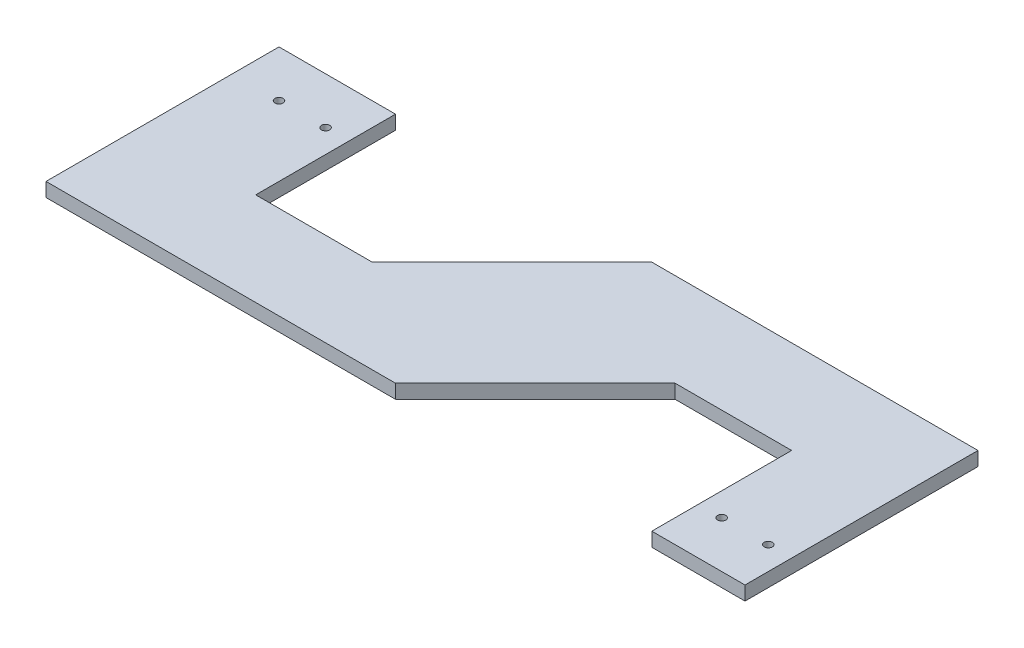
ISO-10303-21;
HEADER;
FILE_DESCRIPTION(('STEP AP214'),'2;1');
FILE_NAME('part.step','',(''),(''),'','','');
FILE_SCHEMA(('AUTOMOTIVE_DESIGN { 1 0 10303 214 1 1 1 1 }'));
ENDSEC;
DATA;
#1=APPLICATION_CONTEXT('core data for automotive mechanical design processes');
#2=APPLICATION_PROTOCOL_DEFINITION('international standard','automotive_design',2000,#1);
#3=PRODUCT_CONTEXT('',#1,'mechanical');
#4=PRODUCT('Part','Part','',(#3));
#5=PRODUCT_RELATED_PRODUCT_CATEGORY('part','',(#4));
#6=PRODUCT_DEFINITION_FORMATION('','',#4);
#7=PRODUCT_DEFINITION_CONTEXT('part definition',#1,'design');
#8=PRODUCT_DEFINITION('design','',#6,#7);
#9=PRODUCT_DEFINITION_SHAPE('','',#8);
#10=(LENGTH_UNIT() NAMED_UNIT(*) SI_UNIT(.MILLI.,.METRE.));
#11=(NAMED_UNIT(*) PLANE_ANGLE_UNIT() SI_UNIT($,.RADIAN.));
#12=(NAMED_UNIT(*) SI_UNIT($,.STERADIAN.) SOLID_ANGLE_UNIT());
#13=UNCERTAINTY_MEASURE_WITH_UNIT(LENGTH_MEASURE(1.E-05),#10,'distance_accuracy_value','');
#14=(GEOMETRIC_REPRESENTATION_CONTEXT(3) GLOBAL_UNCERTAINTY_ASSIGNED_CONTEXT((#13)) GLOBAL_UNIT_ASSIGNED_CONTEXT((#10,
#11,#12)) REPRESENTATION_CONTEXT('',''));
#15=CARTESIAN_POINT('',(0.,0.,0.));
#16=DIRECTION('',(0.,0.,1.));
#17=DIRECTION('',(1.,0.,0.));
#18=AXIS2_PLACEMENT_3D('',#15,#16,#17);
#19=CARTESIAN_POINT('',(20.,6.,-80.));
#20=DIRECTION('',(0.,-1.,0.));
#21=DIRECTION('',(0.,0.,-1.));
#22=AXIS2_PLACEMENT_3D('',#19,#20,#21);
#23=CYLINDRICAL_SURFACE('',#22,1.75);
#24=CARTESIAN_POINT('',(20.,6.,-80.));
#25=DIRECTION('',(0.,1.,0.));
#26=DIRECTION('',(0.,0.,1.));
#27=AXIS2_PLACEMENT_3D('',#24,#25,#26);
#28=CIRCLE('',#27,1.75);
#29=CARTESIAN_POINT('',(20.,6.,-78.25));
#30=VERTEX_POINT('',#29);
#31=EDGE_CURVE('E158',#30,#30,#28,.T.);
#32=ORIENTED_EDGE('',*,*,#31,.T.);
#33=EDGE_LOOP('',(#32));
#34=FACE_BOUND('',#33,.T.);
#35=CARTESIAN_POINT('',(20.,3.,-80.));
#36=DIRECTION('',(0.,-1.,0.));
#37=DIRECTION('',(0.,0.,-1.));
#38=AXIS2_PLACEMENT_3D('',#35,#36,#37);
#39=CIRCLE('',#38,1.75);
#40=CARTESIAN_POINT('',(20.,3.,-81.75));
#41=VERTEX_POINT('',#40);
#42=EDGE_CURVE('E34',#41,#41,#39,.T.);
#43=ORIENTED_EDGE('',*,*,#42,.T.);
#44=EDGE_LOOP('',(#43));
#45=FACE_BOUND('',#44,.T.);
#46=ADVANCED_FACE('F30',(#34,#45),#23,.F.);
#47=CARTESIAN_POINT('',(40.,6.,-80.));
#48=DIRECTION('',(0.,-1.,0.));
#49=DIRECTION('',(0.,0.,-1.));
#50=AXIS2_PLACEMENT_3D('',#47,#48,#49);
#51=CYLINDRICAL_SURFACE('',#50,1.75);
#52=CARTESIAN_POINT('',(40.,6.,-80.));
#53=DIRECTION('',(0.,1.,0.));
#54=DIRECTION('',(0.,0.,1.));
#55=AXIS2_PLACEMENT_3D('',#52,#53,#54);
#56=CIRCLE('',#55,1.75);
#57=CARTESIAN_POINT('',(40.,6.,-78.25));
#58=VERTEX_POINT('',#57);
#59=EDGE_CURVE('E237',#58,#58,#56,.T.);
#60=ORIENTED_EDGE('',*,*,#59,.T.);
#61=EDGE_LOOP('',(#60));
#62=FACE_BOUND('',#61,.T.);
#63=CARTESIAN_POINT('',(40.,3.,-80.));
#64=DIRECTION('',(0.,-1.,0.));
#65=DIRECTION('',(0.,0.,-1.));
#66=AXIS2_PLACEMENT_3D('',#63,#64,#65);
#67=CIRCLE('',#66,1.75);
#68=CARTESIAN_POINT('',(40.,3.,-81.75));
#69=VERTEX_POINT('',#68);
#70=EDGE_CURVE('E210',#69,#69,#67,.T.);
#71=ORIENTED_EDGE('',*,*,#70,.T.);
#72=EDGE_LOOP('',(#71));
#73=FACE_BOUND('',#72,.T.);
#74=ADVANCED_FACE('F289',(#62,#73),#51,.F.);
#75=CARTESIAN_POINT('',(270.,6.,-20.));
#76=DIRECTION('',(0.,-1.,0.));
#77=DIRECTION('',(0.,0.,-1.));
#78=AXIS2_PLACEMENT_3D('',#75,#76,#77);
#79=CYLINDRICAL_SURFACE('',#78,1.75000000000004);
#80=CARTESIAN_POINT('',(270.,6.,-20.));
#81=DIRECTION('',(0.,1.,0.));
#82=DIRECTION('',(0.,0.,1.));
#83=AXIS2_PLACEMENT_3D('',#80,#81,#82);
#84=CIRCLE('',#83,1.75000000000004);
#85=CARTESIAN_POINT('',(270.,6.,-18.25));
#86=VERTEX_POINT('',#85);
#87=EDGE_CURVE('E204',#86,#86,#84,.T.);
#88=ORIENTED_EDGE('',*,*,#87,.T.);
#89=EDGE_LOOP('',(#88));
#90=FACE_BOUND('',#89,.T.);
#91=CARTESIAN_POINT('',(270.,3.,-20.));
#92=DIRECTION('',(0.,-1.,0.));
#93=DIRECTION('',(0.,0.,-1.));
#94=AXIS2_PLACEMENT_3D('',#91,#92,#93);
#95=CIRCLE('',#94,1.75000000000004);
#96=CARTESIAN_POINT('',(270.,3.,-21.75));
#97=VERTEX_POINT('',#96);
#98=EDGE_CURVE('E206',#97,#97,#95,.T.);
#99=ORIENTED_EDGE('',*,*,#98,.T.);
#100=EDGE_LOOP('',(#99));
#101=FACE_BOUND('',#100,.T.);
#102=ADVANCED_FACE('F295',(#90,#101),#79,.F.);
#103=CARTESIAN_POINT('',(290.,6.,-20.));
#104=DIRECTION('',(0.,-1.,0.));
#105=DIRECTION('',(0.,0.,-1.));
#106=AXIS2_PLACEMENT_3D('',#103,#104,#105);
#107=CYLINDRICAL_SURFACE('',#106,1.75000000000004);
#108=CARTESIAN_POINT('',(290.,6.,-20.));
#109=DIRECTION('',(0.,1.,0.));
#110=DIRECTION('',(0.,0.,1.));
#111=AXIS2_PLACEMENT_3D('',#108,#109,#110);
#112=CIRCLE('',#111,1.75000000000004);
#113=CARTESIAN_POINT('',(290.,6.,-18.25));
#114=VERTEX_POINT('',#113);
#115=EDGE_CURVE('E240',#114,#114,#112,.T.);
#116=ORIENTED_EDGE('',*,*,#115,.T.);
#117=EDGE_LOOP('',(#116));
#118=FACE_BOUND('',#117,.T.);
#119=CARTESIAN_POINT('',(290.,3.,-20.));
#120=DIRECTION('',(0.,-1.,0.));
#121=DIRECTION('',(0.,0.,-1.));
#122=AXIS2_PLACEMENT_3D('',#119,#120,#121);
#123=CIRCLE('',#122,1.75000000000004);
#124=CARTESIAN_POINT('',(290.,3.,-21.75));
#125=VERTEX_POINT('',#124);
#126=EDGE_CURVE('E201',#125,#125,#123,.T.);
#127=ORIENTED_EDGE('',*,*,#126,.T.);
#128=EDGE_LOOP('',(#127));
#129=FACE_BOUND('',#128,.T.);
#130=ADVANCED_FACE('F301',(#118,#129),#107,.F.);
#131=CARTESIAN_POINT('',(0.,6.,-100.));
#132=DIRECTION('',(0.,-1.,0.));
#133=DIRECTION('',(0.,0.,-1.));
#134=AXIS2_PLACEMENT_3D('',#131,#132,#133);
#135=PLANE('',#134);
#136=ORIENTED_EDGE('',*,*,#59,.F.);
#137=EDGE_LOOP('',(#136));
#138=FACE_BOUND('',#137,.T.);
#139=ORIENTED_EDGE('',*,*,#31,.F.);
#140=EDGE_LOOP('',(#139));
#141=FACE_BOUND('',#140,.T.);
#142=DIRECTION('',(0.,0.,1.));
#143=VECTOR('',#142,1.);
#144=CARTESIAN_POINT('',(0.,6.,0.));
#145=LINE('',#144,#143);
#146=CARTESIAN_POINT('',(0.,6.,-100.));
#147=VERTEX_POINT('',#146);
#148=CARTESIAN_POINT('',(0.,6.,0.));
#149=VERTEX_POINT('',#148);
#150=EDGE_CURVE('E177',#147,#149,#145,.T.);
#151=ORIENTED_EDGE('',*,*,#150,.T.);
#152=DIRECTION('',(1.,0.,0.));
#153=VECTOR('',#152,1.);
#154=CARTESIAN_POINT('',(0.,6.,0.));
#155=LINE('',#154,#153);
#156=CARTESIAN_POINT('',(150.,6.,0.));
#157=VERTEX_POINT('',#156);
#158=EDGE_CURVE('E104',#149,#157,#155,.T.);
#159=ORIENTED_EDGE('',*,*,#158,.T.);
#160=DIRECTION('',(0.707106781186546,0.,-0.707106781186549));
#161=VECTOR('',#160,1.);
#162=CARTESIAN_POINT('',(210.,6.,-60.));
#163=LINE('',#162,#161);
#164=CARTESIAN_POINT('',(210.,6.,-60.));
#165=VERTEX_POINT('',#164);
#166=EDGE_CURVE('E247',#157,#165,#163,.T.);
#167=ORIENTED_EDGE('',*,*,#166,.T.);
#168=DIRECTION('',(1.,0.,0.));
#169=VECTOR('',#168,1.);
#170=CARTESIAN_POINT('',(260.,6.,-60.));
#171=LINE('',#170,#169);
#172=CARTESIAN_POINT('',(260.,6.,-60.));
#173=VERTEX_POINT('',#172);
#174=EDGE_CURVE('E249',#165,#173,#171,.T.);
#175=ORIENTED_EDGE('',*,*,#174,.T.);
#176=DIRECTION('',(0.,0.,1.));
#177=VECTOR('',#176,1.);
#178=CARTESIAN_POINT('',(260.,6.,0.));
#179=LINE('',#178,#177);
#180=CARTESIAN_POINT('',(260.,6.,0.));
#181=VERTEX_POINT('',#180);
#182=EDGE_CURVE('E251',#173,#181,#179,.T.);
#183=ORIENTED_EDGE('',*,*,#182,.T.);
#184=DIRECTION('',(1.,0.,0.));
#185=VECTOR('',#184,1.);
#186=CARTESIAN_POINT('',(260.,6.,0.));
#187=LINE('',#186,#185);
#188=CARTESIAN_POINT('',(300.,6.,0.));
#189=VERTEX_POINT('',#188);
#190=EDGE_CURVE('E253',#181,#189,#187,.T.);
#191=ORIENTED_EDGE('',*,*,#190,.T.);
#192=DIRECTION('',(0.,0.,-1.));
#193=VECTOR('',#192,1.);
#194=CARTESIAN_POINT('',(300.,6.,0.));
#195=LINE('',#194,#193);
#196=CARTESIAN_POINT('',(300.,6.,-100.));
#197=VERTEX_POINT('',#196);
#198=EDGE_CURVE('E255',#189,#197,#195,.T.);
#199=ORIENTED_EDGE('',*,*,#198,.T.);
#200=DIRECTION('',(-1.,0.,0.));
#201=VECTOR('',#200,1.);
#202=CARTESIAN_POINT('',(160.,6.,-100.));
#203=LINE('',#202,#201);
#204=CARTESIAN_POINT('',(160.,6.,-100.));
#205=VERTEX_POINT('',#204);
#206=EDGE_CURVE('E257',#197,#205,#203,.T.);
#207=ORIENTED_EDGE('',*,*,#206,.T.);
#208=DIRECTION('',(-0.707106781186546,0.,0.707106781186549));
#209=VECTOR('',#208,1.);
#210=CARTESIAN_POINT('',(100.,6.,-40.));
#211=LINE('',#210,#209);
#212=CARTESIAN_POINT('',(100.,6.,-40.));
#213=VERTEX_POINT('',#212);
#214=EDGE_CURVE('E136',#205,#213,#211,.T.);
#215=ORIENTED_EDGE('',*,*,#214,.T.);
#216=DIRECTION('',(-1.,0.,0.));
#217=VECTOR('',#216,1.);
#218=CARTESIAN_POINT('',(50.,6.,-40.));
#219=LINE('',#218,#217);
#220=CARTESIAN_POINT('',(50.,6.,-40.));
#221=VERTEX_POINT('',#220);
#222=EDGE_CURVE('E129',#213,#221,#219,.T.);
#223=ORIENTED_EDGE('',*,*,#222,.T.);
#224=DIRECTION('',(0.,0.,-1.));
#225=VECTOR('',#224,1.);
#226=CARTESIAN_POINT('',(50.,6.,-100.));
#227=LINE('',#226,#225);
#228=CARTESIAN_POINT('',(50.,6.,-100.));
#229=VERTEX_POINT('',#228);
#230=EDGE_CURVE('E134',#221,#229,#227,.T.);
#231=ORIENTED_EDGE('',*,*,#230,.T.);
#232=DIRECTION('',(-1.,0.,0.));
#233=VECTOR('',#232,1.);
#234=CARTESIAN_POINT('',(0.,6.,-100.));
#235=LINE('',#234,#233);
#236=EDGE_CURVE('E49',#229,#147,#235,.T.);
#237=ORIENTED_EDGE('',*,*,#236,.T.);
#238=EDGE_LOOP('',(#151,#159,#167,#175,#183,#191,#199,#207,#215,#223,#231,#237));
#239=FACE_BOUND('',#238,.T.);
#240=ORIENTED_EDGE('',*,*,#115,.F.);
#241=EDGE_LOOP('',(#240));
#242=FACE_BOUND('',#241,.T.);
#243=ORIENTED_EDGE('',*,*,#87,.F.);
#244=EDGE_LOOP('',(#243));
#245=FACE_BOUND('',#244,.T.);
#246=ADVANCED_FACE('F131',(#138,#141,#239,#242,#245),#135,.F.);
#247=CARTESIAN_POINT('',(0.,0.,-100.));
#248=DIRECTION('',(0.,-1.,0.));
#249=DIRECTION('',(0.,0.,-1.));
#250=AXIS2_PLACEMENT_3D('',#247,#248,#249);
#251=PLANE('',#250);
#252=CARTESIAN_POINT('',(20.,0.,-80.));
#253=DIRECTION('',(0.,-1.,0.));
#254=DIRECTION('',(0.,0.,-1.));
#255=AXIS2_PLACEMENT_3D('',#252,#253,#254);
#256=CIRCLE('',#255,3.25);
#257=CARTESIAN_POINT('',(20.,0.,-83.25));
#258=VERTEX_POINT('',#257);
#259=EDGE_CURVE('E226',#258,#258,#256,.T.);
#260=ORIENTED_EDGE('',*,*,#259,.F.);
#261=EDGE_LOOP('',(#260));
#262=FACE_BOUND('',#261,.T.);
#263=CARTESIAN_POINT('',(40.,0.,-80.));
#264=DIRECTION('',(0.,-1.,0.));
#265=DIRECTION('',(0.,0.,-1.));
#266=AXIS2_PLACEMENT_3D('',#263,#264,#265);
#267=CIRCLE('',#266,3.25);
#268=CARTESIAN_POINT('',(40.,0.,-83.25));
#269=VERTEX_POINT('',#268);
#270=EDGE_CURVE('E219',#269,#269,#267,.T.);
#271=ORIENTED_EDGE('',*,*,#270,.F.);
#272=EDGE_LOOP('',(#271));
#273=FACE_BOUND('',#272,.T.);
#274=CARTESIAN_POINT('',(270.,0.,-20.));
#275=DIRECTION('',(0.,-1.,0.));
#276=DIRECTION('',(0.,0.,-1.));
#277=AXIS2_PLACEMENT_3D('',#274,#275,#276);
#278=CIRCLE('',#277,3.25000000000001);
#279=CARTESIAN_POINT('',(270.,0.,-23.25));
#280=VERTEX_POINT('',#279);
#281=EDGE_CURVE('E212',#280,#280,#278,.T.);
#282=ORIENTED_EDGE('',*,*,#281,.F.);
#283=EDGE_LOOP('',(#282));
#284=FACE_BOUND('',#283,.T.);
#285=CARTESIAN_POINT('',(290.,0.,-20.));
#286=DIRECTION('',(0.,-1.,0.));
#287=DIRECTION('',(0.,0.,-1.));
#288=AXIS2_PLACEMENT_3D('',#285,#286,#287);
#289=CIRCLE('',#288,3.25000000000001);
#290=CARTESIAN_POINT('',(290.,0.,-23.25));
#291=VERTEX_POINT('',#290);
#292=EDGE_CURVE('E208',#291,#291,#289,.T.);
#293=ORIENTED_EDGE('',*,*,#292,.F.);
#294=EDGE_LOOP('',(#293));
#295=FACE_BOUND('',#294,.T.);
#296=DIRECTION('',(0.,0.,1.));
#297=VECTOR('',#296,1.);
#298=CARTESIAN_POINT('',(0.,0.,0.));
#299=LINE('',#298,#297);
#300=CARTESIAN_POINT('',(0.,0.,-100.));
#301=VERTEX_POINT('',#300);
#302=CARTESIAN_POINT('',(0.,0.,0.));
#303=VERTEX_POINT('',#302);
#304=EDGE_CURVE('E154',#301,#303,#299,.T.);
#305=ORIENTED_EDGE('',*,*,#304,.F.);
#306=DIRECTION('',(-1.,0.,0.));
#307=VECTOR('',#306,1.);
#308=CARTESIAN_POINT('',(0.,0.,-100.));
#309=LINE('',#308,#307);
#310=CARTESIAN_POINT('',(50.,0.,-100.));
#311=VERTEX_POINT('',#310);
#312=EDGE_CURVE('E96',#311,#301,#309,.T.);
#313=ORIENTED_EDGE('',*,*,#312,.F.);
#314=DIRECTION('',(0.,0.,-1.));
#315=VECTOR('',#314,1.);
#316=CARTESIAN_POINT('',(50.,0.,-100.));
#317=LINE('',#316,#315);
#318=CARTESIAN_POINT('',(50.,0.,-40.));
#319=VERTEX_POINT('',#318);
#320=EDGE_CURVE('E90',#319,#311,#317,.T.);
#321=ORIENTED_EDGE('',*,*,#320,.F.);
#322=DIRECTION('',(-1.,0.,0.));
#323=VECTOR('',#322,1.);
#324=CARTESIAN_POINT('',(50.,0.,-40.));
#325=LINE('',#324,#323);
#326=CARTESIAN_POINT('',(100.,0.,-40.));
#327=VERTEX_POINT('',#326);
#328=EDGE_CURVE('E144',#327,#319,#325,.T.);
#329=ORIENTED_EDGE('',*,*,#328,.F.);
#330=DIRECTION('',(-0.707106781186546,0.,0.707106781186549));
#331=VECTOR('',#330,1.);
#332=CARTESIAN_POINT('',(100.,0.,-40.));
#333=LINE('',#332,#331);
#334=CARTESIAN_POINT('',(160.,0.,-100.));
#335=VERTEX_POINT('',#334);
#336=EDGE_CURVE('E172',#335,#327,#333,.T.);
#337=ORIENTED_EDGE('',*,*,#336,.F.);
#338=DIRECTION('',(-1.,0.,0.));
#339=VECTOR('',#338,1.);
#340=CARTESIAN_POINT('',(160.,0.,-100.));
#341=LINE('',#340,#339);
#342=CARTESIAN_POINT('',(300.,0.,-100.));
#343=VERTEX_POINT('',#342);
#344=EDGE_CURVE('E170',#343,#335,#341,.T.);
#345=ORIENTED_EDGE('',*,*,#344,.F.);
#346=DIRECTION('',(0.,0.,-1.));
#347=VECTOR('',#346,1.);
#348=CARTESIAN_POINT('',(300.,0.,0.));
#349=LINE('',#348,#347);
#350=CARTESIAN_POINT('',(300.,0.,0.));
#351=VERTEX_POINT('',#350);
#352=EDGE_CURVE('E168',#351,#343,#349,.T.);
#353=ORIENTED_EDGE('',*,*,#352,.F.);
#354=DIRECTION('',(1.,0.,0.));
#355=VECTOR('',#354,1.);
#356=CARTESIAN_POINT('',(260.,0.,0.));
#357=LINE('',#356,#355);
#358=CARTESIAN_POINT('',(260.,0.,0.));
#359=VERTEX_POINT('',#358);
#360=EDGE_CURVE('E166',#359,#351,#357,.T.);
#361=ORIENTED_EDGE('',*,*,#360,.F.);
#362=DIRECTION('',(0.,0.,1.));
#363=VECTOR('',#362,1.);
#364=CARTESIAN_POINT('',(260.,0.,0.));
#365=LINE('',#364,#363);
#366=CARTESIAN_POINT('',(260.,0.,-60.));
#367=VERTEX_POINT('',#366);
#368=EDGE_CURVE('E164',#367,#359,#365,.T.);
#369=ORIENTED_EDGE('',*,*,#368,.F.);
#370=DIRECTION('',(1.,0.,0.));
#371=VECTOR('',#370,1.);
#372=CARTESIAN_POINT('',(260.,0.,-60.));
#373=LINE('',#372,#371);
#374=CARTESIAN_POINT('',(210.,0.,-60.));
#375=VERTEX_POINT('',#374);
#376=EDGE_CURVE('E162',#375,#367,#373,.T.);
#377=ORIENTED_EDGE('',*,*,#376,.F.);
#378=DIRECTION('',(0.707106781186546,0.,-0.707106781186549));
#379=VECTOR('',#378,1.);
#380=CARTESIAN_POINT('',(210.,0.,-60.));
#381=LINE('',#380,#379);
#382=CARTESIAN_POINT('',(150.,0.,0.));
#383=VERTEX_POINT('',#382);
#384=EDGE_CURVE('E160',#383,#375,#381,.T.);
#385=ORIENTED_EDGE('',*,*,#384,.F.);
#386=DIRECTION('',(1.,0.,0.));
#387=VECTOR('',#386,1.);
#388=CARTESIAN_POINT('',(0.,0.,0.));
#389=LINE('',#388,#387);
#390=EDGE_CURVE('E157',#303,#383,#389,.T.);
#391=ORIENTED_EDGE('',*,*,#390,.F.);
#392=EDGE_LOOP('',(#305,#313,#321,#329,#337,#345,#353,#361,#369,#377,#385,#391));
#393=FACE_BOUND('',#392,.T.);
#394=ADVANCED_FACE('F270',(#262,#273,#284,#295,#393),#251,.T.);
#395=CARTESIAN_POINT('',(0.,6.,0.));
#396=DIRECTION('',(1.,0.,0.));
#397=DIRECTION('',(0.,0.,-1.));
#398=AXIS2_PLACEMENT_3D('',#395,#396,#397);
#399=PLANE('',#398);
#400=ORIENTED_EDGE('',*,*,#304,.T.);
#401=DIRECTION('',(0.,-1.,0.));
#402=VECTOR('',#401,1.);
#403=CARTESIAN_POINT('',(0.,6.,0.));
#404=LINE('',#403,#402);
#405=EDGE_CURVE('E11',#149,#303,#404,.T.);
#406=ORIENTED_EDGE('',*,*,#405,.F.);
#407=ORIENTED_EDGE('',*,*,#150,.F.);
#408=DIRECTION('',(0.,-1.,0.));
#409=VECTOR('',#408,1.);
#410=CARTESIAN_POINT('',(0.,6.,-100.));
#411=LINE('',#410,#409);
#412=EDGE_CURVE('E150',#147,#301,#411,.T.);
#413=ORIENTED_EDGE('',*,*,#412,.T.);
#414=EDGE_LOOP('',(#400,#406,#407,#413));
#415=FACE_BOUND('',#414,.T.);
#416=ADVANCED_FACE('F32',(#415),#399,.F.);
#417=CARTESIAN_POINT('',(0.,6.,0.));
#418=DIRECTION('',(0.,0.,-1.));
#419=DIRECTION('',(-1.,0.,0.));
#420=AXIS2_PLACEMENT_3D('',#417,#418,#419);
#421=PLANE('',#420);
#422=ORIENTED_EDGE('',*,*,#390,.T.);
#423=DIRECTION('',(0.,-1.,0.));
#424=VECTOR('',#423,1.);
#425=CARTESIAN_POINT('',(150.,6.,0.));
#426=LINE('',#425,#424);
#427=EDGE_CURVE('E40',#157,#383,#426,.T.);
#428=ORIENTED_EDGE('',*,*,#427,.F.);
#429=ORIENTED_EDGE('',*,*,#158,.F.);
#430=ORIENTED_EDGE('',*,*,#405,.T.);
#431=EDGE_LOOP('',(#422,#428,#429,#430));
#432=FACE_BOUND('',#431,.T.);
#433=ADVANCED_FACE('F309',(#432),#421,.F.);
#434=CARTESIAN_POINT('',(210.,6.,-60.));
#435=DIRECTION('',(-0.707106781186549,0.,-0.707106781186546));
#436=DIRECTION('',(-0.707106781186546,0.,0.707106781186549));
#437=AXIS2_PLACEMENT_3D('',#434,#435,#436);
#438=PLANE('',#437);
#439=ORIENTED_EDGE('',*,*,#384,.T.);
#440=DIRECTION('',(0.,-1.,0.));
#441=VECTOR('',#440,1.);
#442=CARTESIAN_POINT('',(210.,6.,-60.));
#443=LINE('',#442,#441);
#444=EDGE_CURVE('E196',#165,#375,#443,.T.);
#445=ORIENTED_EDGE('',*,*,#444,.F.);
#446=ORIENTED_EDGE('',*,*,#166,.F.);
#447=ORIENTED_EDGE('',*,*,#427,.T.);
#448=EDGE_LOOP('',(#439,#445,#446,#447));
#449=FACE_BOUND('',#448,.T.);
#450=ADVANCED_FACE('F375',(#449),#438,.F.);
#451=CARTESIAN_POINT('',(260.,6.,-60.));
#452=DIRECTION('',(0.,0.,-1.));
#453=DIRECTION('',(-1.,0.,0.));
#454=AXIS2_PLACEMENT_3D('',#451,#452,#453);
#455=PLANE('',#454);
#456=ORIENTED_EDGE('',*,*,#376,.T.);
#457=DIRECTION('',(0.,-1.,0.));
#458=VECTOR('',#457,1.);
#459=CARTESIAN_POINT('',(260.,6.,-60.));
#460=LINE('',#459,#458);
#461=EDGE_CURVE('E193',#173,#367,#460,.T.);
#462=ORIENTED_EDGE('',*,*,#461,.F.);
#463=ORIENTED_EDGE('',*,*,#174,.F.);
#464=ORIENTED_EDGE('',*,*,#444,.T.);
#465=EDGE_LOOP('',(#456,#462,#463,#464));
#466=FACE_BOUND('',#465,.T.);
#467=ADVANCED_FACE('F383',(#466),#455,.F.);
#468=CARTESIAN_POINT('',(260.,6.,0.));
#469=DIRECTION('',(1.,0.,0.));
#470=DIRECTION('',(0.,0.,-1.));
#471=AXIS2_PLACEMENT_3D('',#468,#469,#470);
#472=PLANE('',#471);
#473=ORIENTED_EDGE('',*,*,#368,.T.);
#474=DIRECTION('',(0.,-1.,0.));
#475=VECTOR('',#474,1.);
#476=CARTESIAN_POINT('',(260.,6.,0.));
#477=LINE('',#476,#475);
#478=EDGE_CURVE('E190',#181,#359,#477,.T.);
#479=ORIENTED_EDGE('',*,*,#478,.F.);
#480=ORIENTED_EDGE('',*,*,#182,.F.);
#481=ORIENTED_EDGE('',*,*,#461,.T.);
#482=EDGE_LOOP('',(#473,#479,#480,#481));
#483=FACE_BOUND('',#482,.T.);
#484=ADVANCED_FACE('F393',(#483),#472,.F.);
#485=CARTESIAN_POINT('',(260.,6.,0.));
#486=DIRECTION('',(0.,0.,-1.));
#487=DIRECTION('',(-1.,0.,0.));
#488=AXIS2_PLACEMENT_3D('',#485,#486,#487);
#489=PLANE('',#488);
#490=ORIENTED_EDGE('',*,*,#360,.T.);
#491=DIRECTION('',(0.,-1.,0.));
#492=VECTOR('',#491,1.);
#493=CARTESIAN_POINT('',(300.,6.,0.));
#494=LINE('',#493,#492);
#495=EDGE_CURVE('E187',#189,#351,#494,.T.);
#496=ORIENTED_EDGE('',*,*,#495,.F.);
#497=ORIENTED_EDGE('',*,*,#190,.F.);
#498=ORIENTED_EDGE('',*,*,#478,.T.);
#499=EDGE_LOOP('',(#490,#496,#497,#498));
#500=FACE_BOUND('',#499,.T.);
#501=ADVANCED_FACE('F403',(#500),#489,.F.);
#502=CARTESIAN_POINT('',(300.,6.,0.));
#503=DIRECTION('',(-1.,0.,0.));
#504=DIRECTION('',(0.,0.,1.));
#505=AXIS2_PLACEMENT_3D('',#502,#503,#504);
#506=PLANE('',#505);
#507=ORIENTED_EDGE('',*,*,#352,.T.);
#508=DIRECTION('',(0.,-1.,0.));
#509=VECTOR('',#508,1.);
#510=CARTESIAN_POINT('',(300.,6.,-100.));
#511=LINE('',#510,#509);
#512=EDGE_CURVE('E184',#197,#343,#511,.T.);
#513=ORIENTED_EDGE('',*,*,#512,.F.);
#514=ORIENTED_EDGE('',*,*,#198,.F.);
#515=ORIENTED_EDGE('',*,*,#495,.T.);
#516=EDGE_LOOP('',(#507,#513,#514,#515));
#517=FACE_BOUND('',#516,.T.);
#518=ADVANCED_FACE('F413',(#517),#506,.F.);
#519=CARTESIAN_POINT('',(160.,6.,-100.));
#520=DIRECTION('',(0.,0.,1.));
#521=DIRECTION('',(1.,0.,0.));
#522=AXIS2_PLACEMENT_3D('',#519,#520,#521);
#523=PLANE('',#522);
#524=ORIENTED_EDGE('',*,*,#344,.T.);
#525=DIRECTION('',(0.,-1.,0.));
#526=VECTOR('',#525,1.);
#527=CARTESIAN_POINT('',(160.,6.,-100.));
#528=LINE('',#527,#526);
#529=EDGE_CURVE('E181',#205,#335,#528,.T.);
#530=ORIENTED_EDGE('',*,*,#529,.F.);
#531=ORIENTED_EDGE('',*,*,#206,.F.);
#532=ORIENTED_EDGE('',*,*,#512,.T.);
#533=EDGE_LOOP('',(#524,#530,#531,#532));
#534=FACE_BOUND('',#533,.T.);
#535=ADVANCED_FACE('F263',(#534),#523,.F.);
#536=CARTESIAN_POINT('',(100.,6.,-40.));
#537=DIRECTION('',(0.707106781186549,0.,0.707106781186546));
#538=DIRECTION('',(0.707106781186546,0.,-0.707106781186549));
#539=AXIS2_PLACEMENT_3D('',#536,#537,#538);
#540=PLANE('',#539);
#541=ORIENTED_EDGE('',*,*,#336,.T.);
#542=DIRECTION('',(0.,-1.,0.));
#543=VECTOR('',#542,1.);
#544=CARTESIAN_POINT('',(100.,6.,-40.));
#545=LINE('',#544,#543);
#546=EDGE_CURVE('E145',#213,#327,#545,.T.);
#547=ORIENTED_EDGE('',*,*,#546,.F.);
#548=ORIENTED_EDGE('',*,*,#214,.F.);
#549=ORIENTED_EDGE('',*,*,#529,.T.);
#550=EDGE_LOOP('',(#541,#547,#548,#549));
#551=FACE_BOUND('',#550,.T.);
#552=ADVANCED_FACE('F267',(#551),#540,.F.);
#553=CARTESIAN_POINT('',(50.,6.,-40.));
#554=DIRECTION('',(0.,0.,1.));
#555=DIRECTION('',(1.,0.,0.));
#556=AXIS2_PLACEMENT_3D('',#553,#554,#555);
#557=PLANE('',#556);
#558=ORIENTED_EDGE('',*,*,#328,.T.);
#559=DIRECTION('',(0.,-1.,0.));
#560=VECTOR('',#559,1.);
#561=CARTESIAN_POINT('',(50.,6.,-40.));
#562=LINE('',#561,#560);
#563=EDGE_CURVE('E141',#221,#319,#562,.T.);
#564=ORIENTED_EDGE('',*,*,#563,.F.);
#565=ORIENTED_EDGE('',*,*,#222,.F.);
#566=ORIENTED_EDGE('',*,*,#546,.T.);
#567=EDGE_LOOP('',(#558,#564,#565,#566));
#568=FACE_BOUND('',#567,.T.);
#569=ADVANCED_FACE('F142',(#568),#557,.F.);
#570=CARTESIAN_POINT('',(50.,6.,-100.));
#571=DIRECTION('',(-1.,0.,0.));
#572=DIRECTION('',(0.,0.,1.));
#573=AXIS2_PLACEMENT_3D('',#570,#571,#572);
#574=PLANE('',#573);
#575=ORIENTED_EDGE('',*,*,#320,.T.);
#576=DIRECTION('',(0.,-1.,0.));
#577=VECTOR('',#576,1.);
#578=CARTESIAN_POINT('',(50.,6.,-100.));
#579=LINE('',#578,#577);
#580=EDGE_CURVE('E146',#229,#311,#579,.T.);
#581=ORIENTED_EDGE('',*,*,#580,.F.);
#582=ORIENTED_EDGE('',*,*,#230,.F.);
#583=ORIENTED_EDGE('',*,*,#563,.T.);
#584=EDGE_LOOP('',(#575,#581,#582,#583));
#585=FACE_BOUND('',#584,.T.);
#586=ADVANCED_FACE('F148',(#585),#574,.F.);
#587=CARTESIAN_POINT('',(0.,6.,-100.));
#588=DIRECTION('',(0.,0.,1.));
#589=DIRECTION('',(1.,0.,0.));
#590=AXIS2_PLACEMENT_3D('',#587,#588,#589);
#591=PLANE('',#590);
#592=ORIENTED_EDGE('',*,*,#312,.T.);
#593=ORIENTED_EDGE('',*,*,#412,.F.);
#594=ORIENTED_EDGE('',*,*,#236,.F.);
#595=ORIENTED_EDGE('',*,*,#580,.T.);
#596=EDGE_LOOP('',(#592,#593,#594,#595));
#597=FACE_BOUND('',#596,.T.);
#598=ADVANCED_FACE('F275',(#597),#591,.F.);
#599=CARTESIAN_POINT('',(290.,3.,-20.));
#600=DIRECTION('',(0.,-1.,0.));
#601=DIRECTION('',(0.,0.,-1.));
#602=AXIS2_PLACEMENT_3D('',#599,#600,#601);
#603=CYLINDRICAL_SURFACE('',#602,3.25000000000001);
#604=CARTESIAN_POINT('',(290.,3.,-20.));
#605=DIRECTION('',(0.,-1.,0.));
#606=DIRECTION('',(0.,0.,-1.));
#607=AXIS2_PLACEMENT_3D('',#604,#605,#606);
#608=CIRCLE('',#607,3.25000000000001);
#609=CARTESIAN_POINT('',(290.,3.,-23.25));
#610=VERTEX_POINT('',#609);
#611=EDGE_CURVE('E205',#610,#610,#608,.T.);
#612=ORIENTED_EDGE('',*,*,#611,.F.);
#613=EDGE_LOOP('',(#612));
#614=FACE_BOUND('',#613,.T.);
#615=ORIENTED_EDGE('',*,*,#292,.T.);
#616=EDGE_LOOP('',(#615));
#617=FACE_BOUND('',#616,.T.);
#618=ADVANCED_FACE('F277',(#614,#617),#603,.F.);
#619=CARTESIAN_POINT('',(290.,3.,-20.));
#620=DIRECTION('',(0.,-1.,0.));
#621=DIRECTION('',(0.,0.,-1.));
#622=AXIS2_PLACEMENT_3D('',#619,#620,#621);
#623=PLANE('',#622);
#624=ORIENTED_EDGE('',*,*,#126,.F.);
#625=EDGE_LOOP('',(#624));
#626=FACE_BOUND('',#625,.T.);
#627=ORIENTED_EDGE('',*,*,#611,.T.);
#628=EDGE_LOOP('',(#627));
#629=FACE_BOUND('',#628,.T.);
#630=ADVANCED_FACE('F283',(#626,#629),#623,.T.);
#631=CARTESIAN_POINT('',(270.,3.,-20.));
#632=DIRECTION('',(0.,-1.,0.));
#633=DIRECTION('',(0.,0.,-1.));
#634=AXIS2_PLACEMENT_3D('',#631,#632,#633);
#635=CYLINDRICAL_SURFACE('',#634,3.25000000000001);
#636=CARTESIAN_POINT('',(270.,3.,-20.));
#637=DIRECTION('',(0.,-1.,0.));
#638=DIRECTION('',(0.,0.,-1.));
#639=AXIS2_PLACEMENT_3D('',#636,#637,#638);
#640=CIRCLE('',#639,3.25000000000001);
#641=CARTESIAN_POINT('',(270.,3.,-23.25));
#642=VERTEX_POINT('',#641);
#643=EDGE_CURVE('E209',#642,#642,#640,.T.);
#644=ORIENTED_EDGE('',*,*,#643,.F.);
#645=EDGE_LOOP('',(#644));
#646=FACE_BOUND('',#645,.T.);
#647=ORIENTED_EDGE('',*,*,#281,.T.);
#648=EDGE_LOOP('',(#647));
#649=FACE_BOUND('',#648,.T.);
#650=ADVANCED_FACE('F320',(#646,#649),#635,.F.);
#651=CARTESIAN_POINT('',(270.,3.,-20.));
#652=DIRECTION('',(0.,-1.,0.));
#653=DIRECTION('',(0.,0.,-1.));
#654=AXIS2_PLACEMENT_3D('',#651,#652,#653);
#655=PLANE('',#654);
#656=ORIENTED_EDGE('',*,*,#98,.F.);
#657=EDGE_LOOP('',(#656));
#658=FACE_BOUND('',#657,.T.);
#659=ORIENTED_EDGE('',*,*,#643,.T.);
#660=EDGE_LOOP('',(#659));
#661=FACE_BOUND('',#660,.T.);
#662=ADVANCED_FACE('F322',(#658,#661),#655,.T.);
#663=CARTESIAN_POINT('',(40.,3.,-80.));
#664=DIRECTION('',(0.,-1.,0.));
#665=DIRECTION('',(0.,0.,-1.));
#666=AXIS2_PLACEMENT_3D('',#663,#664,#665);
#667=CYLINDRICAL_SURFACE('',#666,3.25);
#668=CARTESIAN_POINT('',(40.,3.,-80.));
#669=DIRECTION('',(0.,-1.,0.));
#670=DIRECTION('',(0.,0.,-1.));
#671=AXIS2_PLACEMENT_3D('',#668,#669,#670);
#672=CIRCLE('',#671,3.25);
#673=CARTESIAN_POINT('',(40.,3.,-83.25));
#674=VERTEX_POINT('',#673);
#675=EDGE_CURVE('E213',#674,#674,#672,.T.);
#676=ORIENTED_EDGE('',*,*,#675,.F.);
#677=EDGE_LOOP('',(#676));
#678=FACE_BOUND('',#677,.T.);
#679=ORIENTED_EDGE('',*,*,#270,.T.);
#680=EDGE_LOOP('',(#679));
#681=FACE_BOUND('',#680,.T.);
#682=ADVANCED_FACE('F329',(#678,#681),#667,.F.);
#683=CARTESIAN_POINT('',(40.,3.,-80.));
#684=DIRECTION('',(0.,-1.,0.));
#685=DIRECTION('',(0.,0.,-1.));
#686=AXIS2_PLACEMENT_3D('',#683,#684,#685);
#687=PLANE('',#686);
#688=ORIENTED_EDGE('',*,*,#70,.F.);
#689=EDGE_LOOP('',(#688));
#690=FACE_BOUND('',#689,.T.);
#691=ORIENTED_EDGE('',*,*,#675,.T.);
#692=EDGE_LOOP('',(#691));
#693=FACE_BOUND('',#692,.T.);
#694=ADVANCED_FACE('F502',(#690,#693),#687,.T.);
#695=CARTESIAN_POINT('',(20.,3.,-80.));
#696=DIRECTION('',(0.,-1.,0.));
#697=DIRECTION('',(0.,0.,-1.));
#698=AXIS2_PLACEMENT_3D('',#695,#696,#697);
#699=CYLINDRICAL_SURFACE('',#698,3.25);
#700=CARTESIAN_POINT('',(20.,3.,-80.));
#701=DIRECTION('',(0.,-1.,0.));
#702=DIRECTION('',(0.,0.,-1.));
#703=AXIS2_PLACEMENT_3D('',#700,#701,#702);
#704=CIRCLE('',#703,3.25);
#705=CARTESIAN_POINT('',(20.,3.,-83.25));
#706=VERTEX_POINT('',#705);
#707=EDGE_CURVE('E540',#706,#706,#704,.T.);
#708=ORIENTED_EDGE('',*,*,#707,.F.);
#709=EDGE_LOOP('',(#708));
#710=FACE_BOUND('',#709,.T.);
#711=ORIENTED_EDGE('',*,*,#259,.T.);
#712=EDGE_LOOP('',(#711));
#713=FACE_BOUND('',#712,.T.);
#714=ADVANCED_FACE('F510',(#710,#713),#699,.F.);
#715=CARTESIAN_POINT('',(20.,3.,-80.));
#716=DIRECTION('',(0.,-1.,0.));
#717=DIRECTION('',(0.,0.,-1.));
#718=AXIS2_PLACEMENT_3D('',#715,#716,#717);
#719=PLANE('',#718);
#720=ORIENTED_EDGE('',*,*,#42,.F.);
#721=EDGE_LOOP('',(#720));
#722=FACE_BOUND('',#721,.T.);
#723=ORIENTED_EDGE('',*,*,#707,.T.);
#724=EDGE_LOOP('',(#723));
#725=FACE_BOUND('',#724,.T.);
#726=ADVANCED_FACE('F519',(#722,#725),#719,.T.);
#727=CLOSED_SHELL('',(#46,#74,#102,#130,#246,#394,#416,#433,#450,#467,#484,#501,#518,#535,#552,
#569,#586,#598,#618,#630,#650,#662,#682,#694,#714,#726));
#728=MANIFOLD_SOLID_BREP('B2',#727);
#729=ADVANCED_BREP_SHAPE_REPRESENTATION('',(#18,#728),#14);
#730=SHAPE_DEFINITION_REPRESENTATION(#9,#729);
ENDSEC;
END-ISO-10303-21;
